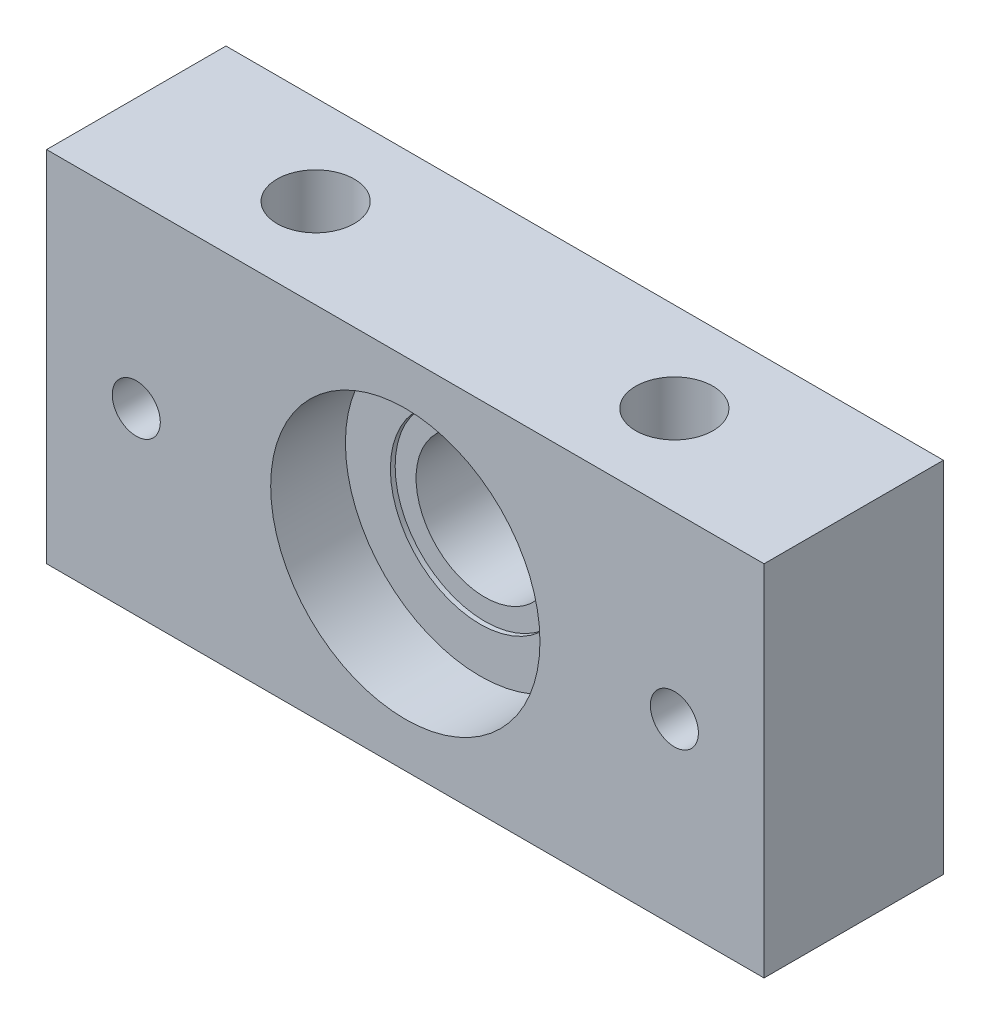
ISO-10303-21;
HEADER;
FILE_DESCRIPTION(('STEP AP214'),'2;1');
FILE_NAME('part.step','',(''),(''),'','','');
FILE_SCHEMA(('AUTOMOTIVE_DESIGN { 1 0 10303 214 1 1 1 1 }'));
ENDSEC;
DATA;
#1=APPLICATION_CONTEXT('core data for automotive mechanical design processes');
#2=APPLICATION_PROTOCOL_DEFINITION('international standard','automotive_design',2000,#1);
#3=PRODUCT_CONTEXT('',#1,'mechanical');
#4=PRODUCT('Part','Part','',(#3));
#5=PRODUCT_RELATED_PRODUCT_CATEGORY('part','',(#4));
#6=PRODUCT_DEFINITION_FORMATION('','',#4);
#7=PRODUCT_DEFINITION_CONTEXT('part definition',#1,'design');
#8=PRODUCT_DEFINITION('design','',#6,#7);
#9=PRODUCT_DEFINITION_SHAPE('','',#8);
#10=(LENGTH_UNIT() NAMED_UNIT(*) SI_UNIT(.MILLI.,.METRE.));
#11=(NAMED_UNIT(*) PLANE_ANGLE_UNIT() SI_UNIT($,.RADIAN.));
#12=(NAMED_UNIT(*) SI_UNIT($,.STERADIAN.) SOLID_ANGLE_UNIT());
#13=UNCERTAINTY_MEASURE_WITH_UNIT(LENGTH_MEASURE(1.E-05),#10,'distance_accuracy_value','');
#14=(GEOMETRIC_REPRESENTATION_CONTEXT(3) GLOBAL_UNCERTAINTY_ASSIGNED_CONTEXT((#13)) GLOBAL_UNIT_ASSIGNED_CONTEXT((#10,
#11,#12)) REPRESENTATION_CONTEXT('',''));
#15=CARTESIAN_POINT('',(0.,0.,0.));
#16=DIRECTION('',(0.,0.,1.));
#17=DIRECTION('',(1.,0.,0.));
#18=AXIS2_PLACEMENT_3D('',#15,#16,#17);
#19=CARTESIAN_POINT('',(38.1,19.05,0.));
#20=DIRECTION('',(0.,0.,1.));
#21=DIRECTION('',(1.,0.,0.));
#22=AXIS2_PLACEMENT_3D('',#19,#20,#21);
#23=CYLINDRICAL_SURFACE('',#22,7.3025);
#24=CARTESIAN_POINT('',(38.1,19.05,0.));
#25=DIRECTION('',(0.,0.,1.));
#26=DIRECTION('',(1.,0.,0.));
#27=AXIS2_PLACEMENT_3D('',#24,#25,#26);
#28=CIRCLE('',#27,7.3025);
#29=CARTESIAN_POINT('',(45.4025,19.05,0.));
#30=VERTEX_POINT('',#29);
#31=EDGE_CURVE('E130',#30,#30,#28,.T.);
#32=ORIENTED_EDGE('',*,*,#31,.F.);
#33=EDGE_LOOP('',(#32));
#34=FACE_BOUND('',#33,.T.);
#35=CARTESIAN_POINT('',(38.1,19.05,10.6045));
#36=DIRECTION('',(0.,0.,1.));
#37=DIRECTION('',(1.,0.,0.));
#38=AXIS2_PLACEMENT_3D('',#35,#36,#37);
#39=CIRCLE('',#38,7.3025);
#40=CARTESIAN_POINT('',(45.4025,19.05,10.6045));
#41=VERTEX_POINT('',#40);
#42=EDGE_CURVE('E38',#41,#41,#39,.F.);
#43=ORIENTED_EDGE('',*,*,#42,.F.);
#44=EDGE_LOOP('',(#43));
#45=FACE_BOUND('',#44,.T.);
#46=ADVANCED_FACE('F34',(#34,#45),#23,.F.);
#47=CARTESIAN_POINT('',(0.,38.1,0.));
#48=DIRECTION('',(0.,0.,-1.));
#49=DIRECTION('',(-1.,0.,0.));
#50=AXIS2_PLACEMENT_3D('',#47,#48,#49);
#51=PLANE('',#50);
#52=CARTESIAN_POINT('',(9.525,19.05,0.));
#53=DIRECTION('',(0.,0.,1.));
#54=DIRECTION('',(1.,0.,0.));
#55=AXIS2_PLACEMENT_3D('',#52,#53,#54);
#56=CIRCLE('',#55,2.5527);
#57=CARTESIAN_POINT('',(12.0777,19.05,0.));
#58=VERTEX_POINT('',#57);
#59=EDGE_CURVE('E144',#58,#58,#56,.T.);
#60=ORIENTED_EDGE('',*,*,#59,.T.);
#61=EDGE_LOOP('',(#60));
#62=FACE_BOUND('',#61,.T.);
#63=DIRECTION('',(0.,-1.,0.));
#64=VECTOR('',#63,1.);
#65=CARTESIAN_POINT('',(0.,0.,0.));
#66=LINE('',#65,#64);
#67=CARTESIAN_POINT('',(0.,38.1,0.));
#68=VERTEX_POINT('',#67);
#69=CARTESIAN_POINT('',(0.,0.,0.));
#70=VERTEX_POINT('',#69);
#71=EDGE_CURVE('E100',#68,#70,#66,.T.);
#72=ORIENTED_EDGE('',*,*,#71,.F.);
#73=DIRECTION('',(-1.,0.,0.));
#74=VECTOR('',#73,1.);
#75=CARTESIAN_POINT('',(0.,38.1,0.));
#76=LINE('',#75,#74);
#77=CARTESIAN_POINT('',(76.2,38.1,0.));
#78=VERTEX_POINT('',#77);
#79=EDGE_CURVE('E75',#78,#68,#76,.T.);
#80=ORIENTED_EDGE('',*,*,#79,.F.);
#81=DIRECTION('',(0.,1.,0.));
#82=VECTOR('',#81,1.);
#83=CARTESIAN_POINT('',(76.2,0.,0.));
#84=LINE('',#83,#82);
#85=CARTESIAN_POINT('',(76.2,0.,0.));
#86=VERTEX_POINT('',#85);
#87=EDGE_CURVE('E69',#86,#78,#84,.T.);
#88=ORIENTED_EDGE('',*,*,#87,.F.);
#89=DIRECTION('',(1.,0.,0.));
#90=VECTOR('',#89,1.);
#91=CARTESIAN_POINT('',(0.,0.,0.));
#92=LINE('',#91,#90);
#93=EDGE_CURVE('E91',#70,#86,#92,.T.);
#94=ORIENTED_EDGE('',*,*,#93,.F.);
#95=EDGE_LOOP('',(#72,#80,#88,#94));
#96=FACE_BOUND('',#95,.T.);
#97=ORIENTED_EDGE('',*,*,#31,.T.);
#98=EDGE_LOOP('',(#97));
#99=FACE_BOUND('',#98,.T.);
#100=CARTESIAN_POINT('',(66.675,19.05,0.));
#101=DIRECTION('',(0.,0.,1.));
#102=DIRECTION('',(1.,0.,0.));
#103=AXIS2_PLACEMENT_3D('',#100,#101,#102);
#104=CIRCLE('',#103,2.55269999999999);
#105=CARTESIAN_POINT('',(69.2277,19.05,0.));
#106=VERTEX_POINT('',#105);
#107=EDGE_CURVE('E138',#106,#106,#104,.T.);
#108=ORIENTED_EDGE('',*,*,#107,.T.);
#109=EDGE_LOOP('',(#108));
#110=FACE_BOUND('',#109,.T.);
#111=ADVANCED_FACE('F111',(#62,#96,#99,#110),#51,.T.);
#112=CARTESIAN_POINT('',(0.,0.,19.05));
#113=DIRECTION('',(1.,0.,0.));
#114=DIRECTION('',(0.,0.,-1.));
#115=AXIS2_PLACEMENT_3D('',#112,#113,#114);
#116=PLANE('',#115);
#117=ORIENTED_EDGE('',*,*,#71,.T.);
#118=DIRECTION('',(0.,0.,-1.));
#119=VECTOR('',#118,1.);
#120=CARTESIAN_POINT('',(0.,0.,19.05));
#121=LINE('',#120,#119);
#122=CARTESIAN_POINT('',(0.,0.,19.05));
#123=VERTEX_POINT('',#122);
#124=EDGE_CURVE('E11',#123,#70,#121,.T.);
#125=ORIENTED_EDGE('',*,*,#124,.F.);
#126=DIRECTION('',(0.,-1.,0.));
#127=VECTOR('',#126,1.);
#128=CARTESIAN_POINT('',(0.,0.,19.05));
#129=LINE('',#128,#127);
#130=CARTESIAN_POINT('',(0.,38.1,19.05));
#131=VERTEX_POINT('',#130);
#132=EDGE_CURVE('E87',#131,#123,#129,.T.);
#133=ORIENTED_EDGE('',*,*,#132,.F.);
#134=DIRECTION('',(0.,0.,-1.));
#135=VECTOR('',#134,1.);
#136=CARTESIAN_POINT('',(0.,38.1,19.05));
#137=LINE('',#136,#135);
#138=EDGE_CURVE('E96',#131,#68,#137,.T.);
#139=ORIENTED_EDGE('',*,*,#138,.T.);
#140=EDGE_LOOP('',(#117,#125,#133,#139));
#141=FACE_BOUND('',#140,.T.);
#142=ADVANCED_FACE('F36',(#141),#116,.F.);
#143=CARTESIAN_POINT('',(0.,0.,19.05));
#144=DIRECTION('',(0.,1.,0.));
#145=DIRECTION('',(0.,0.,1.));
#146=AXIS2_PLACEMENT_3D('',#143,#144,#145);
#147=PLANE('',#146);
#148=CARTESIAN_POINT('',(19.05,0.,9.525));
#149=DIRECTION('',(0.,1.,0.));
#150=DIRECTION('',(0.,0.,1.));
#151=AXIS2_PLACEMENT_3D('',#148,#149,#150);
#152=CIRCLE('',#151,4.10209999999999);
#153=CARTESIAN_POINT('',(19.05,0.,13.6271));
#154=VERTEX_POINT('',#153);
#155=EDGE_CURVE('E123',#154,#154,#152,.T.);
#156=ORIENTED_EDGE('',*,*,#155,.T.);
#157=EDGE_LOOP('',(#156));
#158=FACE_BOUND('',#157,.T.);
#159=CARTESIAN_POINT('',(57.15,0.,9.525));
#160=DIRECTION('',(0.,1.,0.));
#161=DIRECTION('',(0.,0.,1.));
#162=AXIS2_PLACEMENT_3D('',#159,#160,#161);
#163=CIRCLE('',#162,4.10209999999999);
#164=CARTESIAN_POINT('',(57.15,0.,13.6271));
#165=VERTEX_POINT('',#164);
#166=EDGE_CURVE('E117',#165,#165,#163,.T.);
#167=ORIENTED_EDGE('',*,*,#166,.T.);
#168=EDGE_LOOP('',(#167));
#169=FACE_BOUND('',#168,.T.);
#170=ORIENTED_EDGE('',*,*,#93,.T.);
#171=DIRECTION('',(0.,0.,-1.));
#172=VECTOR('',#171,1.);
#173=CARTESIAN_POINT('',(76.2,0.,19.05));
#174=LINE('',#173,#172);
#175=CARTESIAN_POINT('',(76.2,0.,19.05));
#176=VERTEX_POINT('',#175);
#177=EDGE_CURVE('E44',#176,#86,#174,.T.);
#178=ORIENTED_EDGE('',*,*,#177,.F.);
#179=DIRECTION('',(1.,0.,0.));
#180=VECTOR('',#179,1.);
#181=CARTESIAN_POINT('',(0.,0.,19.05));
#182=LINE('',#181,#180);
#183=EDGE_CURVE('E82',#123,#176,#182,.T.);
#184=ORIENTED_EDGE('',*,*,#183,.F.);
#185=ORIENTED_EDGE('',*,*,#124,.T.);
#186=EDGE_LOOP('',(#170,#178,#184,#185));
#187=FACE_BOUND('',#186,.T.);
#188=ADVANCED_FACE('F90',(#158,#169,#187),#147,.F.);
#189=CARTESIAN_POINT('',(76.2,0.,19.05));
#190=DIRECTION('',(-1.,0.,0.));
#191=DIRECTION('',(0.,0.,1.));
#192=AXIS2_PLACEMENT_3D('',#189,#190,#191);
#193=PLANE('',#192);
#194=ORIENTED_EDGE('',*,*,#87,.T.);
#195=DIRECTION('',(0.,0.,-1.));
#196=VECTOR('',#195,1.);
#197=CARTESIAN_POINT('',(76.2,38.1,19.05));
#198=LINE('',#197,#196);
#199=CARTESIAN_POINT('',(76.2,38.1,19.05));
#200=VERTEX_POINT('',#199);
#201=EDGE_CURVE('E92',#200,#78,#198,.T.);
#202=ORIENTED_EDGE('',*,*,#201,.F.);
#203=DIRECTION('',(0.,1.,0.));
#204=VECTOR('',#203,1.);
#205=CARTESIAN_POINT('',(76.2,0.,19.05));
#206=LINE('',#205,#204);
#207=EDGE_CURVE('E85',#176,#200,#206,.T.);
#208=ORIENTED_EDGE('',*,*,#207,.F.);
#209=ORIENTED_EDGE('',*,*,#177,.T.);
#210=EDGE_LOOP('',(#194,#202,#208,#209));
#211=FACE_BOUND('',#210,.T.);
#212=ADVANCED_FACE('F94',(#211),#193,.F.);
#213=CARTESIAN_POINT('',(0.,38.1,19.05));
#214=DIRECTION('',(0.,-1.,0.));
#215=DIRECTION('',(0.,0.,-1.));
#216=AXIS2_PLACEMENT_3D('',#213,#214,#215);
#217=PLANE('',#216);
#218=CARTESIAN_POINT('',(19.05,38.1,9.525));
#219=DIRECTION('',(0.,1.,0.));
#220=DIRECTION('',(0.,0.,1.));
#221=AXIS2_PLACEMENT_3D('',#218,#219,#220);
#222=CIRCLE('',#221,4.10209999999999);
#223=CARTESIAN_POINT('',(19.05,38.1,13.6271));
#224=VERTEX_POINT('',#223);
#225=EDGE_CURVE('E120',#224,#224,#222,.T.);
#226=ORIENTED_EDGE('',*,*,#225,.F.);
#227=EDGE_LOOP('',(#226));
#228=FACE_BOUND('',#227,.T.);
#229=CARTESIAN_POINT('',(57.15,38.1,9.525));
#230=DIRECTION('',(0.,1.,0.));
#231=DIRECTION('',(0.,0.,1.));
#232=AXIS2_PLACEMENT_3D('',#229,#230,#231);
#233=CIRCLE('',#232,4.1021);
#234=CARTESIAN_POINT('',(57.15,38.1,13.6271));
#235=VERTEX_POINT('',#234);
#236=EDGE_CURVE('E103',#235,#235,#233,.T.);
#237=ORIENTED_EDGE('',*,*,#236,.F.);
#238=EDGE_LOOP('',(#237));
#239=FACE_BOUND('',#238,.T.);
#240=ORIENTED_EDGE('',*,*,#79,.T.);
#241=ORIENTED_EDGE('',*,*,#138,.F.);
#242=DIRECTION('',(-1.,0.,0.));
#243=VECTOR('',#242,1.);
#244=CARTESIAN_POINT('',(0.,38.1,19.05));
#245=LINE('',#244,#243);
#246=EDGE_CURVE('E52',#200,#131,#245,.T.);
#247=ORIENTED_EDGE('',*,*,#246,.F.);
#248=ORIENTED_EDGE('',*,*,#201,.T.);
#249=EDGE_LOOP('',(#240,#241,#247,#248));
#250=FACE_BOUND('',#249,.T.);
#251=ADVANCED_FACE('F108',(#228,#239,#250),#217,.F.);
#252=CARTESIAN_POINT('',(0.,38.1,19.05));
#253=DIRECTION('',(0.,0.,-1.));
#254=DIRECTION('',(-1.,0.,0.));
#255=AXIS2_PLACEMENT_3D('',#252,#253,#254);
#256=PLANE('',#255);
#257=CARTESIAN_POINT('',(9.525,19.05,19.05));
#258=DIRECTION('',(0.,0.,1.));
#259=DIRECTION('',(1.,0.,0.));
#260=AXIS2_PLACEMENT_3D('',#257,#258,#259);
#261=CIRCLE('',#260,2.55269999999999);
#262=CARTESIAN_POINT('',(12.0777,19.05,19.05));
#263=VERTEX_POINT('',#262);
#264=EDGE_CURVE('E141',#263,#263,#261,.T.);
#265=ORIENTED_EDGE('',*,*,#264,.F.);
#266=EDGE_LOOP('',(#265));
#267=FACE_BOUND('',#266,.T.);
#268=CARTESIAN_POINT('',(66.675,19.05,19.05));
#269=DIRECTION('',(0.,0.,1.));
#270=DIRECTION('',(1.,0.,0.));
#271=AXIS2_PLACEMENT_3D('',#268,#269,#270);
#272=CIRCLE('',#271,2.55269999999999);
#273=CARTESIAN_POINT('',(69.2277,19.05,19.05));
#274=VERTEX_POINT('',#273);
#275=EDGE_CURVE('E135',#274,#274,#272,.T.);
#276=ORIENTED_EDGE('',*,*,#275,.F.);
#277=EDGE_LOOP('',(#276));
#278=FACE_BOUND('',#277,.T.);
#279=CARTESIAN_POINT('',(38.1,19.05,19.05));
#280=DIRECTION('',(0.,0.,1.));
#281=DIRECTION('',(1.,0.,0.));
#282=AXIS2_PLACEMENT_3D('',#279,#280,#281);
#283=CIRCLE('',#282,14.3002);
#284=CARTESIAN_POINT('',(52.4002,19.05,19.05));
#285=VERTEX_POINT('',#284);
#286=EDGE_CURVE('E127',#285,#285,#283,.T.);
#287=ORIENTED_EDGE('',*,*,#286,.F.);
#288=EDGE_LOOP('',(#287));
#289=FACE_BOUND('',#288,.T.);
#290=ORIENTED_EDGE('',*,*,#132,.T.);
#291=ORIENTED_EDGE('',*,*,#183,.T.);
#292=ORIENTED_EDGE('',*,*,#207,.T.);
#293=ORIENTED_EDGE('',*,*,#246,.T.);
#294=EDGE_LOOP('',(#290,#291,#292,#293));
#295=FACE_BOUND('',#294,.T.);
#296=ADVANCED_FACE('F83',(#267,#278,#289,#295),#256,.F.);
#297=CARTESIAN_POINT('',(57.15,38.1,9.525));
#298=DIRECTION('',(0.,1.,0.));
#299=DIRECTION('',(0.,0.,1.));
#300=AXIS2_PLACEMENT_3D('',#297,#298,#299);
#301=CYLINDRICAL_SURFACE('',#300,4.10209999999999);
#302=ORIENTED_EDGE('',*,*,#166,.F.);
#303=EDGE_LOOP('',(#302));
#304=FACE_BOUND('',#303,.T.);
#305=ORIENTED_EDGE('',*,*,#236,.T.);
#306=EDGE_LOOP('',(#305));
#307=FACE_BOUND('',#306,.T.);
#308=ADVANCED_FACE('F183',(#304,#307),#301,.F.);
#309=CARTESIAN_POINT('',(19.05,38.1,9.525));
#310=DIRECTION('',(0.,1.,0.));
#311=DIRECTION('',(0.,0.,1.));
#312=AXIS2_PLACEMENT_3D('',#309,#310,#311);
#313=CYLINDRICAL_SURFACE('',#312,4.10209999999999);
#314=ORIENTED_EDGE('',*,*,#155,.F.);
#315=EDGE_LOOP('',(#314));
#316=FACE_BOUND('',#315,.T.);
#317=ORIENTED_EDGE('',*,*,#225,.T.);
#318=EDGE_LOOP('',(#317));
#319=FACE_BOUND('',#318,.T.);
#320=ADVANCED_FACE('F179',(#316,#319),#313,.F.);
#321=CARTESIAN_POINT('',(38.1,19.05,11.1125));
#322=DIRECTION('',(0.,0.,1.));
#323=DIRECTION('',(1.,0.,0.));
#324=AXIS2_PLACEMENT_3D('',#321,#322,#323);
#325=CYLINDRICAL_SURFACE('',#324,14.3002);
#326=CARTESIAN_POINT('',(38.1,19.05,11.1125));
#327=DIRECTION('',(0.,0.,1.));
#328=DIRECTION('',(1.,0.,0.));
#329=AXIS2_PLACEMENT_3D('',#326,#327,#328);
#330=CIRCLE('',#329,14.3002);
#331=CARTESIAN_POINT('',(52.4002,19.05,11.1125));
#332=VERTEX_POINT('',#331);
#333=EDGE_CURVE('E126',#332,#332,#330,.T.);
#334=ORIENTED_EDGE('',*,*,#333,.F.);
#335=EDGE_LOOP('',(#334));
#336=FACE_BOUND('',#335,.T.);
#337=ORIENTED_EDGE('',*,*,#286,.T.);
#338=EDGE_LOOP('',(#337));
#339=FACE_BOUND('',#338,.T.);
#340=ADVANCED_FACE('F175',(#336,#339),#325,.F.);
#341=CARTESIAN_POINT('',(38.1,19.05,11.1125));
#342=DIRECTION('',(0.,0.,1.));
#343=DIRECTION('',(1.,0.,0.));
#344=AXIS2_PLACEMENT_3D('',#341,#342,#343);
#345=PLANE('',#344);
#346=CARTESIAN_POINT('',(38.1,19.05,11.1125));
#347=DIRECTION('',(0.,0.,1.));
#348=DIRECTION('',(1.,0.,0.));
#349=AXIS2_PLACEMENT_3D('',#346,#347,#348);
#350=CIRCLE('',#349,9.525);
#351=CARTESIAN_POINT('',(47.625,19.05,11.1125));
#352=VERTEX_POINT('',#351);
#353=EDGE_CURVE('E147',#352,#352,#350,.T.);
#354=ORIENTED_EDGE('',*,*,#353,.F.);
#355=EDGE_LOOP('',(#354));
#356=FACE_BOUND('',#355,.T.);
#357=ORIENTED_EDGE('',*,*,#333,.T.);
#358=EDGE_LOOP('',(#357));
#359=FACE_BOUND('',#358,.T.);
#360=ADVANCED_FACE('F172',(#356,#359),#345,.T.);
#361=CARTESIAN_POINT('',(66.675,19.05,19.05));
#362=DIRECTION('',(0.,0.,1.));
#363=DIRECTION('',(1.,0.,0.));
#364=AXIS2_PLACEMENT_3D('',#361,#362,#363);
#365=CYLINDRICAL_SURFACE('',#364,2.55269999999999);
#366=ORIENTED_EDGE('',*,*,#107,.F.);
#367=EDGE_LOOP('',(#366));
#368=FACE_BOUND('',#367,.T.);
#369=ORIENTED_EDGE('',*,*,#275,.T.);
#370=EDGE_LOOP('',(#369));
#371=FACE_BOUND('',#370,.T.);
#372=ADVANCED_FACE('F170',(#368,#371),#365,.F.);
#373=CARTESIAN_POINT('',(9.525,19.05,19.05));
#374=DIRECTION('',(0.,0.,1.));
#375=DIRECTION('',(1.,0.,0.));
#376=AXIS2_PLACEMENT_3D('',#373,#374,#375);
#377=CYLINDRICAL_SURFACE('',#376,2.55269999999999);
#378=ORIENTED_EDGE('',*,*,#59,.F.);
#379=EDGE_LOOP('',(#378));
#380=FACE_BOUND('',#379,.T.);
#381=ORIENTED_EDGE('',*,*,#264,.T.);
#382=EDGE_LOOP('',(#381));
#383=FACE_BOUND('',#382,.T.);
#384=ADVANCED_FACE('F238',(#380,#383),#377,.F.);
#385=CARTESIAN_POINT('',(38.1,19.05,10.6045));
#386=DIRECTION('',(0.,0.,1.));
#387=DIRECTION('',(1.,0.,0.));
#388=AXIS2_PLACEMENT_3D('',#385,#386,#387);
#389=PLANE('',#388);
#390=CARTESIAN_POINT('',(38.1,19.05,10.6045));
#391=DIRECTION('',(0.,0.,1.));
#392=DIRECTION('',(1.,0.,0.));
#393=AXIS2_PLACEMENT_3D('',#390,#391,#392);
#394=CIRCLE('',#393,9.525);
#395=CARTESIAN_POINT('',(47.625,19.05,10.6045));
#396=VERTEX_POINT('',#395);
#397=EDGE_CURVE('E150',#396,#396,#394,.T.);
#398=ORIENTED_EDGE('',*,*,#397,.T.);
#399=EDGE_LOOP('',(#398));
#400=FACE_BOUND('',#399,.T.);
#401=ORIENTED_EDGE('',*,*,#42,.T.);
#402=EDGE_LOOP('',(#401));
#403=FACE_BOUND('',#402,.T.);
#404=ADVANCED_FACE('F157',(#400,#403),#389,.T.);
#405=CARTESIAN_POINT('',(38.1,19.05,10.6045));
#406=DIRECTION('',(0.,0.,1.));
#407=DIRECTION('',(1.,0.,0.));
#408=AXIS2_PLACEMENT_3D('',#405,#406,#407);
#409=CYLINDRICAL_SURFACE('',#408,9.525);
#410=ORIENTED_EDGE('',*,*,#397,.F.);
#411=EDGE_LOOP('',(#410));
#412=FACE_BOUND('',#411,.T.);
#413=ORIENTED_EDGE('',*,*,#353,.T.);
#414=EDGE_LOOP('',(#413));
#415=FACE_BOUND('',#414,.T.);
#416=ADVANCED_FACE('F265',(#412,#415),#409,.F.);
#417=CLOSED_SHELL('',(#46,#111,#142,#188,#212,#251,#296,#308,#320,#340,#360,#372,#384,#404,#416));
#418=MANIFOLD_SOLID_BREP('B2',#417);
#419=ADVANCED_BREP_SHAPE_REPRESENTATION('',(#18,#418),#14);
#420=SHAPE_DEFINITION_REPRESENTATION(#9,#419);
ENDSEC;
END-ISO-10303-21;
